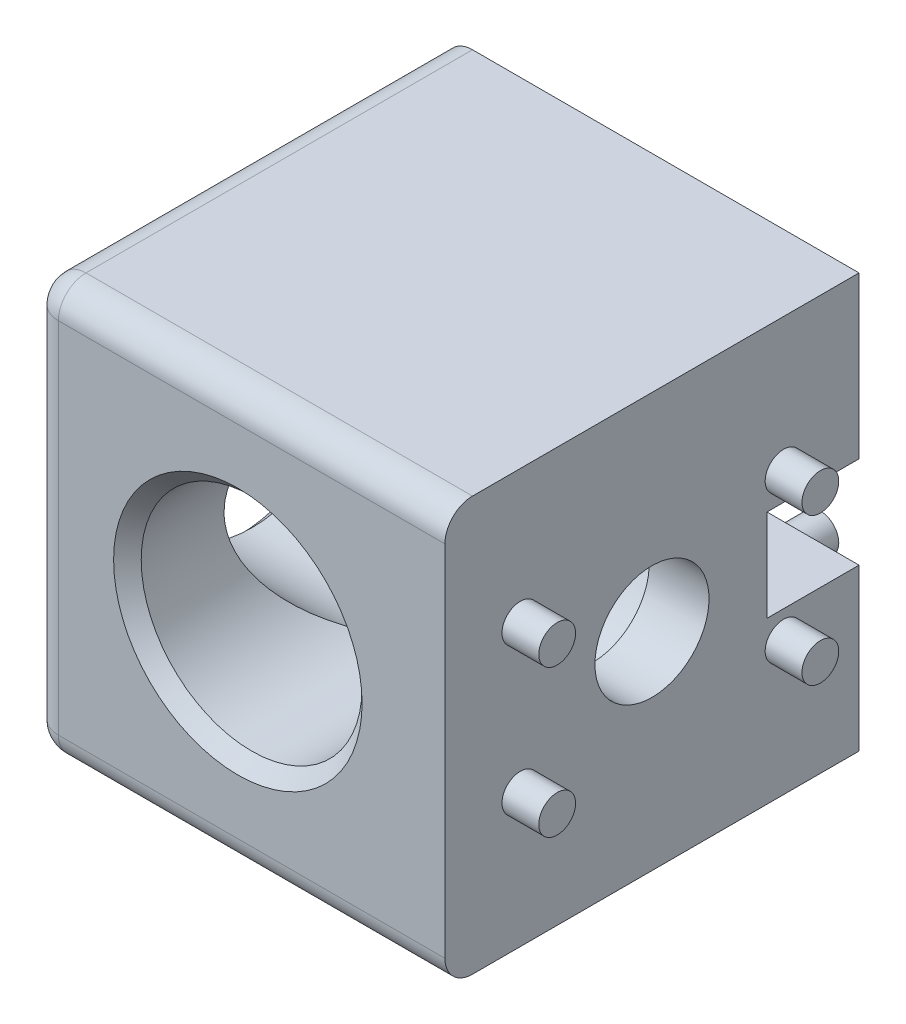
ISO-10303-21;
HEADER;
FILE_DESCRIPTION(('STEP AP214'),'2;1');
FILE_NAME('part.step','',(''),(''),'','','');
FILE_SCHEMA(('AUTOMOTIVE_DESIGN { 1 0 10303 214 1 1 1 1 }'));
ENDSEC;
DATA;
#1=APPLICATION_CONTEXT('core data for automotive mechanical design processes');
#2=APPLICATION_PROTOCOL_DEFINITION('international standard','automotive_design',2000,#1);
#3=PRODUCT_CONTEXT('',#1,'mechanical');
#4=PRODUCT('Part','Part','',(#3));
#5=PRODUCT_RELATED_PRODUCT_CATEGORY('part','',(#4));
#6=PRODUCT_DEFINITION_FORMATION('','',#4);
#7=PRODUCT_DEFINITION_CONTEXT('part definition',#1,'design');
#8=PRODUCT_DEFINITION('design','',#6,#7);
#9=PRODUCT_DEFINITION_SHAPE('','',#8);
#10=(LENGTH_UNIT() NAMED_UNIT(*) SI_UNIT(.MILLI.,.METRE.));
#11=(NAMED_UNIT(*) PLANE_ANGLE_UNIT() SI_UNIT($,.RADIAN.));
#12=(NAMED_UNIT(*) SI_UNIT($,.STERADIAN.) SOLID_ANGLE_UNIT());
#13=UNCERTAINTY_MEASURE_WITH_UNIT(LENGTH_MEASURE(1.E-05),#10,'distance_accuracy_value','');
#14=(GEOMETRIC_REPRESENTATION_CONTEXT(3) GLOBAL_UNCERTAINTY_ASSIGNED_CONTEXT((#13)) GLOBAL_UNIT_ASSIGNED_CONTEXT((#10,
#11,#12)) REPRESENTATION_CONTEXT('',''));
#15=CARTESIAN_POINT('',(0.,0.,0.));
#16=DIRECTION('',(0.,0.,1.));
#17=DIRECTION('',(1.,0.,0.));
#18=AXIS2_PLACEMENT_3D('',#15,#16,#17);
#19=CARTESIAN_POINT('',(0.,0.,22.5));
#20=DIRECTION('',(-1.,0.,0.));
#21=DIRECTION('',(0.,0.,1.));
#22=AXIS2_PLACEMENT_3D('',#19,#20,#21);
#23=PLANE('',#22);
#24=DIRECTION('',(0.,1.,0.));
#25=VECTOR('',#24,1.);
#26=CARTESIAN_POINT('',(-1.11022302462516E-13,0.,22.5));
#27=LINE('',#26,#25);
#28=CARTESIAN_POINT('',(-1.13135050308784E-13,-10.5,22.5000000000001));
#29=VERTEX_POINT('',#28);
#30=CARTESIAN_POINT('',(0.,-12.,22.5));
#31=VERTEX_POINT('',#30);
#32=EDGE_CURVE('E145',#29,#31,#27,.F.);
#33=ORIENTED_EDGE('',*,*,#32,.F.);
#34=DIRECTION('',(0.,0.,1.));
#35=VECTOR('',#34,1.);
#36=CARTESIAN_POINT('',(-1.13839299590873E-13,-10.5,6.5));
#37=LINE('',#36,#35);
#38=CARTESIAN_POINT('',(0.,-10.5,16.6905249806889));
#39=VERTEX_POINT('',#38);
#40=EDGE_CURVE('E128',#29,#39,#37,.F.);
#41=ORIENTED_EDGE('',*,*,#40,.T.);
#42=CARTESIAN_POINT('',(0.,0.,22.5));
#43=DIRECTION('',(-1.,0.,0.));
#44=DIRECTION('',(0.,0.,1.));
#45=AXIS2_PLACEMENT_3D('',#42,#43,#44);
#46=CIRCLE('',#45,12.);
#47=EDGE_CURVE('E20',#39,#31,#46,.T.);
#48=ORIENTED_EDGE('',*,*,#47,.T.);
#49=EDGE_LOOP('',(#33,#41,#48));
#50=FACE_BOUND('',#49,.T.);
#51=ADVANCED_FACE('F16',(#50),#23,.T.);
#52=CARTESIAN_POINT('',(0.,0.,22.5));
#53=DIRECTION('',(-1.,0.,0.));
#54=DIRECTION('',(0.,0.,1.));
#55=AXIS2_PLACEMENT_3D('',#52,#53,#54);
#56=PLANE('',#55);
#57=CARTESIAN_POINT('',(1.13161279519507E-13,0.,22.5));
#58=DIRECTION('',(-1.,0.,0.));
#59=DIRECTION('',(0.,0.,1.));
#60=AXIS2_PLACEMENT_3D('',#57,#58,#59);
#61=CIRCLE('',#60,12.);
#62=CARTESIAN_POINT('',(1.56312282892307E-13,12.,22.4999999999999));
#63=VERTEX_POINT('',#62);
#64=CARTESIAN_POINT('',(0.,10.5,16.6905249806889));
#65=VERTEX_POINT('',#64);
#66=EDGE_CURVE('E135',#63,#65,#61,.T.);
#67=ORIENTED_EDGE('',*,*,#66,.T.);
#68=DIRECTION('',(0.,0.,1.));
#69=VECTOR('',#68,1.);
#70=CARTESIAN_POINT('',(0.,10.5,6.5));
#71=LINE('',#70,#69);
#72=CARTESIAN_POINT('',(0.,10.5,22.5));
#73=VERTEX_POINT('',#72);
#74=EDGE_CURVE('E131',#65,#73,#71,.T.);
#75=ORIENTED_EDGE('',*,*,#74,.T.);
#76=DIRECTION('',(0.,1.,0.));
#77=VECTOR('',#76,1.);
#78=CARTESIAN_POINT('',(1.13161279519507E-13,0.,22.5));
#79=LINE('',#78,#77);
#80=EDGE_CURVE('E148',#63,#73,#79,.F.);
#81=ORIENTED_EDGE('',*,*,#80,.F.);
#82=EDGE_LOOP('',(#67,#75,#81));
#83=FACE_BOUND('',#82,.T.);
#84=ADVANCED_FACE('F373',(#83),#56,.T.);
#85=CARTESIAN_POINT('',(0.,0.,22.5));
#86=DIRECTION('',(0.,0.,1.));
#87=DIRECTION('',(1.,0.,0.));
#88=AXIS2_PLACEMENT_3D('',#85,#86,#87);
#89=PLANE('',#88);
#90=CARTESIAN_POINT('',(0.,0.,22.5));
#91=DIRECTION('',(0.,0.,1.));
#92=DIRECTION('',(1.,0.,0.));
#93=AXIS2_PLACEMENT_3D('',#90,#91,#92);
#94=CIRCLE('',#93,12.);
#95=CARTESIAN_POINT('',(5.80947501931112,-10.5,22.5));
#96=VERTEX_POINT('',#95);
#97=EDGE_CURVE('E344',#31,#96,#94,.T.);
#98=ORIENTED_EDGE('',*,*,#97,.T.);
#99=DIRECTION('',(-1.,0.,0.));
#100=VECTOR('',#99,1.);
#101=CARTESIAN_POINT('',(16.,-10.5,22.5000000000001));
#102=LINE('',#101,#100);
#103=EDGE_CURVE('E349',#96,#29,#102,.T.);
#104=ORIENTED_EDGE('',*,*,#103,.T.);
#105=ORIENTED_EDGE('',*,*,#32,.T.);
#106=EDGE_LOOP('',(#98,#104,#105));
#107=FACE_BOUND('',#106,.T.);
#108=ADVANCED_FACE('F368',(#107),#89,.T.);
#109=CARTESIAN_POINT('',(0.,0.,22.5));
#110=DIRECTION('',(0.,0.,1.));
#111=DIRECTION('',(1.,0.,0.));
#112=AXIS2_PLACEMENT_3D('',#109,#110,#111);
#113=PLANE('',#112);
#114=ORIENTED_EDGE('',*,*,#80,.T.);
#115=DIRECTION('',(-1.,0.,0.));
#116=VECTOR('',#115,1.);
#117=CARTESIAN_POINT('',(16.,10.5,22.5));
#118=LINE('',#117,#116);
#119=CARTESIAN_POINT('',(5.80947501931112,10.5,22.4999999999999));
#120=VERTEX_POINT('',#119);
#121=EDGE_CURVE('E134',#73,#120,#118,.F.);
#122=ORIENTED_EDGE('',*,*,#121,.T.);
#123=CARTESIAN_POINT('',(0.,0.,22.4999999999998));
#124=DIRECTION('',(0.,0.,1.));
#125=DIRECTION('',(1.,0.,0.));
#126=AXIS2_PLACEMENT_3D('',#123,#124,#125);
#127=CIRCLE('',#126,12.);
#128=EDGE_CURVE('E343',#120,#63,#127,.T.);
#129=ORIENTED_EDGE('',*,*,#128,.T.);
#130=EDGE_LOOP('',(#114,#122,#129));
#131=FACE_BOUND('',#130,.T.);
#132=ADVANCED_FACE('F364',(#131),#113,.T.);
#133=CARTESIAN_POINT('',(0.,0.,6.5));
#134=DIRECTION('',(0.,0.,1.));
#135=DIRECTION('',(1.,0.,0.));
#136=AXIS2_PLACEMENT_3D('',#133,#134,#135);
#137=CYLINDRICAL_SURFACE('',#136,10.5);
#138=CARTESIAN_POINT('',(0.,0.,22.5));
#139=DIRECTION('',(0.707106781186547,0.,0.707106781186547));
#140=DIRECTION('',(-0.707106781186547,0.,0.707106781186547));
#141=AXIS2_PLACEMENT_3D('',#138,#139,#140);
#142=ELLIPSE('',#141,14.8492424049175,10.5);
#143=EDGE_CURVE('E348',#29,#73,#142,.T.);
#144=ORIENTED_EDGE('',*,*,#143,.T.);
#145=ORIENTED_EDGE('',*,*,#74,.F.);
#146=CARTESIAN_POINT('',(0.,10.5,16.6905249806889));
#147=CARTESIAN_POINT('',(-0.17095684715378,10.5000419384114,16.6906723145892));
#148=CARTESIAN_POINT('',(-0.341815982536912,10.4958268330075,16.6829822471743));
#149=CARTESIAN_POINT('',(-0.681474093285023,10.479226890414,16.6530938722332));
#150=CARTESIAN_POINT('',(-0.85027694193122,10.4668611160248,16.6309294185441));
#151=CARTESIAN_POINT('',(-1.18198103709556,10.4345726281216,16.5737295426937));
#152=CARTESIAN_POINT('',(-1.34493375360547,10.4147792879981,16.5389147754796));
#153=CARTESIAN_POINT('',(-1.66706231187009,10.3680953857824,16.4580805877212));
#154=CARTESIAN_POINT('',(-1.82623560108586,10.3412001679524,16.4120538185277));
#155=CARTESIAN_POINT('',(-2.211463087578,10.2671052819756,16.2876030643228));
#156=CARTESIAN_POINT('',(-2.43512025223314,10.2162284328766,16.2039518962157));
#157=CARTESIAN_POINT('',(-2.87299969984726,10.1018389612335,16.0220065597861));
#158=CARTESIAN_POINT('',(-3.08721738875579,10.0383202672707,15.9237053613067));
#159=CARTESIAN_POINT('',(-3.50852470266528,9.89898622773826,15.7157628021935));
#160=CARTESIAN_POINT('',(-3.71553098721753,9.8230635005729,15.6060257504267));
#161=CARTESIAN_POINT('',(-4.12099645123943,9.65997624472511,15.3792975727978));
#162=CARTESIAN_POINT('',(-4.31945257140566,9.57280773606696,15.2623038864));
#163=CARTESIAN_POINT('',(-4.82243142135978,9.33332872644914,14.9537268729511));
#164=CARTESIAN_POINT('',(-5.12091286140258,9.17279217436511,14.7586325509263));
#165=CARTESIAN_POINT('',(-5.69928428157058,8.82507808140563,14.3644450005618));
#166=CARTESIAN_POINT('',(-5.97916420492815,8.6378862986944,14.1653496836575));
#167=CARTESIAN_POINT('',(-6.51976493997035,8.23744395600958,13.7693864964));
#168=CARTESIAN_POINT('',(-6.78053532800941,8.02426494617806,13.572514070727));
#169=CARTESIAN_POINT('',(-7.28288255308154,7.5712561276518,13.1852349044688));
#170=CARTESIAN_POINT('',(-7.52446796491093,7.33143834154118,12.9948252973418));
#171=CARTESIAN_POINT('',(-7.93351311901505,6.88323979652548,12.6674362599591));
#172=CARTESIAN_POINT('',(-8.1052295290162,6.68034121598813,12.5282519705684));
#173=CARTESIAN_POINT('',(-8.43517170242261,6.2585585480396,12.2582655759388));
#174=CARTESIAN_POINT('',(-8.59339773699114,6.03967478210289,12.1274633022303));
#175=CARTESIAN_POINT('',(-8.89478212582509,5.58631184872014,11.876431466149));
#176=CARTESIAN_POINT('',(-9.0379526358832,5.3518455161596,11.7561933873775));
#177=CARTESIAN_POINT('',(-9.30764950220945,4.86768882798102,11.5283485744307));
#178=CARTESIAN_POINT('',(-9.43417960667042,4.61800191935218,11.4207389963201));
#179=CARTESIAN_POINT('',(-9.64679644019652,4.15235318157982,11.239083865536));
#180=CARTESIAN_POINT('',(-9.73602304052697,3.93880221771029,11.1625232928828));
#181=CARTESIAN_POINT('',(-9.90114781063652,3.5030739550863,11.0204111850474));
#182=CARTESIAN_POINT('',(-9.97704868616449,3.28089841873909,10.9548574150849));
#183=CARTESIAN_POINT('',(-10.1143708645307,2.82932748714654,10.8359819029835));
#184=CARTESIAN_POINT('',(-10.1758157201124,2.59994453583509,10.782640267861));
#185=CARTESIAN_POINT('',(-10.2834033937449,2.13506900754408,10.6890863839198));
#186=CARTESIAN_POINT('',(-10.3295514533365,1.89957855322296,10.6488696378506));
#187=CARTESIAN_POINT('',(-10.4113975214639,1.3889297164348,10.5774694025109));
#188=CARTESIAN_POINT('',(-10.4445491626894,1.1130449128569,10.5484941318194));
#189=CARTESIAN_POINT('',(-10.4888518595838,0.558098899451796,10.5097582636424));
#190=CARTESIAN_POINT('',(-10.4999981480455,0.279037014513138,10.5000018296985));
#191=CARTESIAN_POINT('',(-10.5000016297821,-0.245561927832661,10.499998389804));
#192=CARTESIAN_POINT('',(-10.4913723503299,-0.491104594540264,10.5075513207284));
#193=CARTESIAN_POINT('',(-10.45702544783,-0.980163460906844,10.5375875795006));
#194=CARTESIAN_POINT('',(-10.4313016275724,-1.22367889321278,10.5600763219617));
#195=CARTESIAN_POINT('',(-10.3632096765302,-1.70690121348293,10.6195185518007));
#196=CARTESIAN_POINT('',(-10.3208192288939,-1.94660254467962,10.6564914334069));
#197=CARTESIAN_POINT('',(-10.2201695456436,-2.42006439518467,10.7440971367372));
#198=CARTESIAN_POINT('',(-10.1619113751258,-2.65382531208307,10.7947290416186));
#199=CARTESIAN_POINT('',(-10.0309229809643,-3.11240769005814,10.9082634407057));
#200=CARTESIAN_POINT('',(-9.95829098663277,-3.33727803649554,10.9710825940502));
#201=CARTESIAN_POINT('',(-9.79936784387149,-3.77854359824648,11.1080735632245));
#202=CARTESIAN_POINT('',(-9.71307676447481,-3.99493885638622,11.1822453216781));
#203=CARTESIAN_POINT('',(-9.5279158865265,-4.4183959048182,11.3407486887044));
#204=CARTESIAN_POINT('',(-9.4290462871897,-4.62545784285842,11.4250801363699));
#205=CARTESIAN_POINT('',(-9.2197654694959,-5.02968690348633,11.6027060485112));
#206=CARTESIAN_POINT('',(-9.10935170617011,-5.22685182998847,11.696002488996));
#207=CARTESIAN_POINT('',(-8.83312486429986,-5.6853006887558,11.9280329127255));
#208=CARTESIAN_POINT('',(-8.66242104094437,-5.94183349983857,12.0703674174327));
#209=CARTESIAN_POINT('',(-8.30296073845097,-6.4345884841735,12.3669435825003));
#210=CARTESIAN_POINT('',(-8.11419777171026,-6.67080330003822,12.521189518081));
#211=CARTESIAN_POINT('',(-7.72006529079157,-7.12325751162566,12.8389559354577));
#212=CARTESIAN_POINT('',(-7.51466182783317,-7.33945403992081,13.0024951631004));
#213=CARTESIAN_POINT('',(-7.08895670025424,-7.75141491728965,13.3356272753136));
#214=CARTESIAN_POINT('',(-6.86865702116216,-7.94718198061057,13.5052193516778));
#215=CARTESIAN_POINT('',(-6.40912270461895,-8.32244016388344,13.8511012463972));
#216=CARTESIAN_POINT('',(-6.16958673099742,-8.50150098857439,14.027456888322));
#217=CARTESIAN_POINT('',(-5.67590652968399,-8.83874956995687,14.3799028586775));
#218=CARTESIAN_POINT('',(-5.42175780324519,-8.99693084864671,14.5559930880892));
#219=CARTESIAN_POINT('',(-4.8986499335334,-9.29211461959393,14.9033886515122));
#220=CARTESIAN_POINT('',(-4.62970191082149,-9.42913272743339,15.0746974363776));
#221=CARTESIAN_POINT('',(-4.07574300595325,-9.68147241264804,15.4068738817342));
#222=CARTESIAN_POINT('',(-3.79074423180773,-9.79681006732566,15.5677492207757));
#223=CARTESIAN_POINT('',(-3.33722139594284,-9.95698593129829,15.8016071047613));
#224=CARTESIAN_POINT('',(-3.1749432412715,-10.0099655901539,15.8811772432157));
#225=CARTESIAN_POINT('',(-2.84480130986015,-10.1087489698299,16.0330547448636));
#226=CARTESIAN_POINT('',(-2.67693635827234,-10.154551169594,16.1053605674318));
#227=CARTESIAN_POINT('',(-2.33650142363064,-10.2382280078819,16.2402110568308));
#228=CARTESIAN_POINT('',(-2.16396257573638,-10.2761450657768,16.3028074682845));
#229=CARTESIAN_POINT('',(-1.81356370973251,-10.343730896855,16.4162839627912));
#230=CARTESIAN_POINT('',(-1.63570789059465,-10.3734059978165,16.4671730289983));
#231=CARTESIAN_POINT('',(-1.33775627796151,-10.4151118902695,16.539585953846));
#232=CARTESIAN_POINT('',(-1.21899656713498,-10.4296937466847,16.5651753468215));
#233=CARTESIAN_POINT('',(-0.979828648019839,-10.4548739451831,16.6096467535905));
#234=CARTESIAN_POINT('',(-0.859420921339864,-10.4654734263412,16.6285306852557));
#235=CARTESIAN_POINT('',(-0.616230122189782,-10.4826161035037,16.6591874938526));
#236=CARTESIAN_POINT('',(-0.493435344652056,-10.4891194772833,16.6708905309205));
#237=CARTESIAN_POINT('',(-0.247100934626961,-10.4978194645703,16.6865842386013));
#238=CARTESIAN_POINT('',(-0.123560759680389,-10.5000124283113,16.6905683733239));
#239=CARTESIAN_POINT('',(0.,-10.5,16.6905249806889));
#240=B_SPLINE_CURVE_WITH_KNOTS('',3,(#146,#147,#148,#149,#150,#151,#152,#153,#154,#155,#156,
#157,#158,#159,#160,#161,#162,#163,#164,#165,#166,#167,#168,#169,#170,#171,#172,#173,#174,#175,
#176,#177,#178,#179,#180,#181,#182,#183,#184,#185,#186,#187,#188,#189,#190,#191,#192,#193,#194,
#195,#196,#197,#198,#199,#200,#201,#202,#203,#204,#205,#206,#207,#208,#209,#210,#211,#212,#213,
#214,#215,#216,#217,#218,#219,#220,#221,#222,#223,#224,#225,#226,#227,#228,#229,#230,#231,#232,
#233,#234,#235,#236,#237,#238,#239),.UNSPECIFIED.,.F.,.F.,(4,2,2,2,2,2,2,2,2,2,2,2,2,2,2,2,2,2,
2,2,2,2,2,2,2,2,2,2,2,2,2,2,2,2,2,2,2,2,2,2,2,2,2,2,2,2,4),(0.,0.51248970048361,
1.02378502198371,1.52655943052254,2.02966426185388,2.76087250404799,3.49243277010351,
4.23069898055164,4.96922719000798,6.14080877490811,7.31301869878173,8.48207115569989,
9.65059812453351,10.5499741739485,11.4493321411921,12.3479583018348,13.2463817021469,
13.9770086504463,14.7074870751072,15.43676698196,16.1657967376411,17.0023879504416,
17.8391603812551,18.5755481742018,19.3122030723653,20.0498477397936,20.7874429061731,
21.5201614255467,22.252876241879,22.9855794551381,23.7184445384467,24.7352261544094,
25.7523744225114,26.7716527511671,27.7907954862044,28.8314303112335,29.8723872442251,
30.9125723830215,31.9519830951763,32.5167215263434,33.0815794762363,33.6433152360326,
34.2046185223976,34.5714631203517,34.9382027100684,35.3084548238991,35.6790203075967),.UNSPECIFIED.);
#241=EDGE_CURVE('E123',#65,#39,#240,.T.);
#242=ORIENTED_EDGE('',*,*,#241,.T.);
#243=ORIENTED_EDGE('',*,*,#40,.F.);
#244=EDGE_LOOP('',(#144,#145,#242,#243));
#245=FACE_BOUND('',#244,.T.);
#246=CARTESIAN_POINT('',(0.,0.,6.5));
#247=DIRECTION('',(0.,0.,1.));
#248=DIRECTION('',(1.,0.,0.));
#249=AXIS2_PLACEMENT_3D('',#246,#247,#248);
#250=CIRCLE('',#249,10.5);
#251=CARTESIAN_POINT('',(10.5,0.,6.5));
#252=VERTEX_POINT('',#251);
#253=EDGE_CURVE('E161',#252,#252,#250,.T.);
#254=ORIENTED_EDGE('',*,*,#253,.F.);
#255=EDGE_LOOP('',(#254));
#256=FACE_BOUND('',#255,.T.);
#257=ADVANCED_FACE('F125',(#245,#256),#137,.F.);
#258=CARTESIAN_POINT('',(0.,0.,22.5));
#259=DIRECTION('',(-1.,0.,0.));
#260=DIRECTION('',(0.,0.,1.));
#261=AXIS2_PLACEMENT_3D('',#258,#259,#260);
#262=CYLINDRICAL_SURFACE('',#261,12.);
#263=CARTESIAN_POINT('',(0.,0.,22.5));
#264=DIRECTION('',(-0.707106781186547,0.,-0.707106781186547));
#265=DIRECTION('',(-0.707106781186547,0.,0.707106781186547));
#266=AXIS2_PLACEMENT_3D('',#263,#264,#265);
#267=ELLIPSE('',#266,16.9705627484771,12.);
#268=EDGE_CURVE('E142',#63,#31,#267,.F.);
#269=ORIENTED_EDGE('',*,*,#268,.T.);
#270=ORIENTED_EDGE('',*,*,#47,.F.);
#271=ORIENTED_EDGE('',*,*,#241,.F.);
#272=ORIENTED_EDGE('',*,*,#66,.F.);
#273=EDGE_LOOP('',(#269,#270,#271,#272));
#274=FACE_BOUND('',#273,.T.);
#275=CARTESIAN_POINT('',(-21.,0.,22.5));
#276=DIRECTION('',(-1.,0.,0.));
#277=DIRECTION('',(0.,0.,1.));
#278=AXIS2_PLACEMENT_3D('',#275,#276,#277);
#279=CIRCLE('',#278,12.);
#280=CARTESIAN_POINT('',(-21.,0.,34.5));
#281=VERTEX_POINT('',#280);
#282=EDGE_CURVE('E151',#281,#281,#279,.T.);
#283=ORIENTED_EDGE('',*,*,#282,.T.);
#284=EDGE_LOOP('',(#283));
#285=FACE_BOUND('',#284,.T.);
#286=ADVANCED_FACE('F139',(#274,#285),#262,.F.);
#287=CARTESIAN_POINT('',(16.,0.,22.5));
#288=DIRECTION('',(-1.,0.,0.));
#289=DIRECTION('',(0.,0.,1.));
#290=AXIS2_PLACEMENT_3D('',#287,#288,#289);
#291=CYLINDRICAL_SURFACE('',#290,10.5);
#292=ORIENTED_EDGE('',*,*,#103,.F.);
#293=CARTESIAN_POINT('',(5.80947501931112,-10.5,22.5000000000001));
#294=CARTESIAN_POINT('',(5.80932768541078,-10.5000419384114,22.6709568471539));
#295=CARTESIAN_POINT('',(5.81701775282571,-10.4958268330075,22.841815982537));
#296=CARTESIAN_POINT('',(5.84690612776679,-10.479226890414,23.1814740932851));
#297=CARTESIAN_POINT('',(5.86907058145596,-10.4668611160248,23.3502769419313));
#298=CARTESIAN_POINT('',(5.92627045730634,-10.4345726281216,23.6819810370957));
#299=CARTESIAN_POINT('',(5.96108522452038,-10.4147792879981,23.8449337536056));
#300=CARTESIAN_POINT('',(6.04191941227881,-10.3680953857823,24.1670623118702));
#301=CARTESIAN_POINT('',(6.0879461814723,-10.3412001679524,24.326235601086));
#302=CARTESIAN_POINT('',(6.21239693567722,-10.2671052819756,24.7114630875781));
#303=CARTESIAN_POINT('',(6.29604810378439,-10.2162284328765,24.9351202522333));
#304=CARTESIAN_POINT('',(6.47799344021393,-10.1018389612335,25.3729996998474));
#305=CARTESIAN_POINT('',(6.57629463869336,-10.0383202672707,25.5872173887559));
#306=CARTESIAN_POINT('',(6.78423719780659,-9.89898622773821,26.0085247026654));
#307=CARTESIAN_POINT('',(6.89397424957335,-9.82306350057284,26.2155309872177));
#308=CARTESIAN_POINT('',(7.12070242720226,-9.65997624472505,26.6209964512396));
#309=CARTESIAN_POINT('',(7.23769611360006,-9.57280773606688,26.8194525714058));
#310=CARTESIAN_POINT('',(7.54627312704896,-9.33332872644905,27.3224314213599));
#311=CARTESIAN_POINT('',(7.74136744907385,-9.17279217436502,27.6209128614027));
#312=CARTESIAN_POINT('',(8.13555499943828,-8.82507808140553,28.1992842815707));
#313=CARTESIAN_POINT('',(8.33465031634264,-8.63788629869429,28.4791642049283));
#314=CARTESIAN_POINT('',(8.73061350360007,-8.23744395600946,29.0197649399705));
#315=CARTESIAN_POINT('',(8.92748592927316,-8.02426494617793,29.2805353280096));
#316=CARTESIAN_POINT('',(9.31476509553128,-7.57125612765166,29.7828825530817));
#317=CARTESIAN_POINT('',(9.50517470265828,-7.33143834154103,30.0244679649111));
#318=CARTESIAN_POINT('',(9.83256374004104,-6.88323979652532,30.4335131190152));
#319=CARTESIAN_POINT('',(9.97174802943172,-6.68034121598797,30.6052295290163));
#320=CARTESIAN_POINT('',(10.2417344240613,-6.25855854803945,30.9351717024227));
#321=CARTESIAN_POINT('',(10.3725366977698,-6.03967478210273,31.0933977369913));
#322=CARTESIAN_POINT('',(10.6235685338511,-5.58631184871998,31.3947821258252));
#323=CARTESIAN_POINT('',(10.7438066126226,-5.35184551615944,31.5379526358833));
#324=CARTESIAN_POINT('',(10.9716514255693,-4.86768882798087,31.8076495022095));
#325=CARTESIAN_POINT('',(11.0792610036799,-4.61800191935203,31.9341796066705));
#326=CARTESIAN_POINT('',(11.260916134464,-4.15235318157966,32.1467964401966));
#327=CARTESIAN_POINT('',(11.3374767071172,-3.93880221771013,32.236023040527));
#328=CARTESIAN_POINT('',(11.4795888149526,-3.50307395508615,32.4011478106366));
#329=CARTESIAN_POINT('',(11.5451425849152,-3.28089841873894,32.4770486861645));
#330=CARTESIAN_POINT('',(11.6640180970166,-2.82932748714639,32.6143708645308));
#331=CARTESIAN_POINT('',(11.717359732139,-2.59994453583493,32.6758157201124));
#332=CARTESIAN_POINT('',(11.8109136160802,-2.13506900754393,32.7834033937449));
#333=CARTESIAN_POINT('',(11.8511303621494,-1.89957855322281,32.8295514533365));
#334=CARTESIAN_POINT('',(11.9225305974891,-1.38892971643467,32.9113975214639));
#335=CARTESIAN_POINT('',(11.9515058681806,-1.1130449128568,32.9445491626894));
#336=CARTESIAN_POINT('',(11.9902417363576,-0.558098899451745,32.9888518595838));
#337=CARTESIAN_POINT('',(11.9999981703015,-0.279037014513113,32.9999981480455));
#338=CARTESIAN_POINT('',(12.000001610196,0.245561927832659,33.0000016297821));
#339=CARTESIAN_POINT('',(11.9924486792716,0.49110459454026,32.9913723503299));
#340=CARTESIAN_POINT('',(11.9624124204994,0.98016346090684,32.95702544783));
#341=CARTESIAN_POINT('',(11.9399236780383,1.22367889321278,32.9313016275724));
#342=CARTESIAN_POINT('',(11.8804814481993,1.70690121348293,32.8632096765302));
#343=CARTESIAN_POINT('',(11.8435085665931,1.94660254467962,32.8208192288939));
#344=CARTESIAN_POINT('',(11.7559028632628,2.42006439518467,32.7201695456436));
#345=CARTESIAN_POINT('',(11.7052709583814,2.65382531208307,32.6619113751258));
#346=CARTESIAN_POINT('',(11.5917365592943,3.11240769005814,32.5309229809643));
#347=CARTESIAN_POINT('',(11.5289174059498,3.33727803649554,32.4582909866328));
#348=CARTESIAN_POINT('',(11.3919264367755,3.77854359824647,32.2993678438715));
#349=CARTESIAN_POINT('',(11.3177546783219,3.99493885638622,32.2130767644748));
#350=CARTESIAN_POINT('',(11.1592513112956,4.4183959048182,32.0279158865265));
#351=CARTESIAN_POINT('',(11.0749198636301,4.62545784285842,31.9290462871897));
#352=CARTESIAN_POINT('',(10.8972939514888,5.02968690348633,31.7197654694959));
#353=CARTESIAN_POINT('',(10.803997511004,5.22685182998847,31.6093517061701));
#354=CARTESIAN_POINT('',(10.5719670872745,5.6853006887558,31.3331248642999));
#355=CARTESIAN_POINT('',(10.4296325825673,5.94183349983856,31.1624210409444));
#356=CARTESIAN_POINT('',(10.1330564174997,6.4345884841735,30.802960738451));
#357=CARTESIAN_POINT('',(9.97881048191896,6.67080330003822,30.6141977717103));
#358=CARTESIAN_POINT('',(9.6610440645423,7.12325751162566,30.2200652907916));
#359=CARTESIAN_POINT('',(9.4975048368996,7.33945403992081,30.0146618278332));
#360=CARTESIAN_POINT('',(9.16437272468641,7.75141491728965,29.5889567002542));
#361=CARTESIAN_POINT('',(8.99478064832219,7.94718198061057,29.3686570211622));
#362=CARTESIAN_POINT('',(8.64889875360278,8.32244016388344,28.9091227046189));
#363=CARTESIAN_POINT('',(8.47254311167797,8.50150098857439,28.6695867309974));
#364=CARTESIAN_POINT('',(8.12009714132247,8.83874956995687,28.175906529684));
#365=CARTESIAN_POINT('',(7.94400691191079,8.99693084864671,27.9217578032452));
#366=CARTESIAN_POINT('',(7.59661134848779,9.29211461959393,27.3986499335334));
#367=CARTESIAN_POINT('',(7.4253025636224,9.42913272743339,27.1297019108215));
#368=CARTESIAN_POINT('',(7.0931261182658,9.68147241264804,26.5757430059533));
#369=CARTESIAN_POINT('',(6.93225077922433,9.79681006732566,26.2907442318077));
#370=CARTESIAN_POINT('',(6.69839289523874,9.95698593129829,25.8372213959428));
#371=CARTESIAN_POINT('',(6.61882275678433,10.0099655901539,25.6749432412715));
#372=CARTESIAN_POINT('',(6.4669452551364,10.1087489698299,25.3448013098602));
#373=CARTESIAN_POINT('',(6.39463943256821,10.154551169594,25.1769363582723));
#374=CARTESIAN_POINT('',(6.25978894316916,10.2382280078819,24.8365014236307));
#375=CARTESIAN_POINT('',(6.19719253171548,10.2761450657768,24.6639625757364));
#376=CARTESIAN_POINT('',(6.08371603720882,10.343730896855,24.3135637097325));
#377=CARTESIAN_POINT('',(6.03282697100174,10.3734059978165,24.1357078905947));
#378=CARTESIAN_POINT('',(5.96041404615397,10.4151118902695,23.8377562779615));
#379=CARTESIAN_POINT('',(5.93482465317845,10.4296937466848,23.718996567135));
#380=CARTESIAN_POINT('',(5.8903532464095,10.4548739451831,23.4798286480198));
#381=CARTESIAN_POINT('',(5.87146931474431,10.4654734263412,23.3594209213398));
#382=CARTESIAN_POINT('',(5.84081250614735,10.4826161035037,23.1162301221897));
#383=CARTESIAN_POINT('',(5.82910946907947,10.4891194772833,22.993435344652));
#384=CARTESIAN_POINT('',(5.81341576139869,10.4978194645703,22.7471009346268));
#385=CARTESIAN_POINT('',(5.80943162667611,10.5000124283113,22.6235607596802));
#386=CARTESIAN_POINT('',(5.80947501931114,10.5,22.4999999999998));
#387=B_SPLINE_CURVE_WITH_KNOTS('',3,(#293,#294,#295,#296,#297,#298,#299,#300,#301,#302,#303,
#304,#305,#306,#307,#308,#309,#310,#311,#312,#313,#314,#315,#316,#317,#318,#319,#320,#321,#322,
#323,#324,#325,#326,#327,#328,#329,#330,#331,#332,#333,#334,#335,#336,#337,#338,#339,#340,#341,
#342,#343,#344,#345,#346,#347,#348,#349,#350,#351,#352,#353,#354,#355,#356,#357,#358,#359,#360,
#361,#362,#363,#364,#365,#366,#367,#368,#369,#370,#371,#372,#373,#374,#375,#376,#377,#378,#379,
#380,#381,#382,#383,#384,#385,#386),.UNSPECIFIED.,.F.,.F.,(4,2,2,2,2,2,2,2,2,2,2,2,2,2,2,2,2,2,
2,2,2,2,2,2,2,2,2,2,2,2,2,2,2,2,2,2,2,2,2,2,2,2,2,2,2,2,4),(0.,0.512489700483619,
1.02378502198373,1.52655943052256,2.02966426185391,2.76087250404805,3.49243277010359,
4.23069898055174,4.96922719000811,6.14080877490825,7.31301869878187,8.48207115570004,
9.65059812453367,10.5499741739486,11.4493321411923,12.3479583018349,13.246381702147,
13.9770086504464,14.7074870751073,15.4367669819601,16.1657967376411,17.0023879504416,
17.839160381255,18.5755481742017,19.3122030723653,20.0498477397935,20.7874429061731,
21.5201614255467,22.2528762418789,22.985579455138,23.7184445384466,24.7352261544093,
25.7523744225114,26.771652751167,27.7907954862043,28.8314303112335,29.872387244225,
30.9125723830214,31.9519830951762,32.5167215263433,33.0815794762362,33.6433152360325,
34.2046185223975,34.5714631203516,34.9382027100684,35.3084548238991,35.6790203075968),.UNSPECIFIED.);
#388=EDGE_CURVE('E335',#96,#120,#387,.T.);
#389=ORIENTED_EDGE('',*,*,#388,.T.);
#390=ORIENTED_EDGE('',*,*,#121,.F.);
#391=ORIENTED_EDGE('',*,*,#143,.F.);
#392=EDGE_LOOP('',(#292,#389,#390,#391));
#393=FACE_BOUND('',#392,.T.);
#394=CARTESIAN_POINT('',(16.,0.,22.5));
#395=DIRECTION('',(-1.,0.,0.));
#396=DIRECTION('',(0.,0.,1.));
#397=AXIS2_PLACEMENT_3D('',#394,#395,#396);
#398=CIRCLE('',#397,10.5);
#399=CARTESIAN_POINT('',(16.,0.,33.));
#400=VERTEX_POINT('',#399);
#401=EDGE_CURVE('E394',#400,#400,#398,.T.);
#402=ORIENTED_EDGE('',*,*,#401,.F.);
#403=EDGE_LOOP('',(#402));
#404=FACE_BOUND('',#403,.T.);
#405=ADVANCED_FACE('F330',(#393,#404),#291,.F.);
#406=CARTESIAN_POINT('',(0.,0.,22.5));
#407=DIRECTION('',(0.,0.,1.));
#408=DIRECTION('',(1.,0.,0.));
#409=AXIS2_PLACEMENT_3D('',#406,#407,#408);
#410=CYLINDRICAL_SURFACE('',#409,12.);
#411=ORIENTED_EDGE('',*,*,#388,.F.);
#412=ORIENTED_EDGE('',*,*,#97,.F.);
#413=ORIENTED_EDGE('',*,*,#268,.F.);
#414=ORIENTED_EDGE('',*,*,#128,.F.);
#415=EDGE_LOOP('',(#411,#412,#413,#414));
#416=FACE_BOUND('',#415,.T.);
#417=CARTESIAN_POINT('',(0.,0.,43.5));
#418=DIRECTION('',(0.,0.,1.));
#419=DIRECTION('',(1.,0.,0.));
#420=AXIS2_PLACEMENT_3D('',#417,#418,#419);
#421=CIRCLE('',#420,12.);
#422=CARTESIAN_POINT('',(12.,0.,43.5));
#423=VERTEX_POINT('',#422);
#424=EDGE_CURVE('E390',#423,#423,#421,.T.);
#425=ORIENTED_EDGE('',*,*,#424,.T.);
#426=EDGE_LOOP('',(#425));
#427=FACE_BOUND('',#426,.T.);
#428=ADVANCED_FACE('F325',(#416,#427),#410,.F.);
#429=CARTESIAN_POINT('',(0.,0.,6.5));
#430=DIRECTION('',(0.,0.,1.));
#431=DIRECTION('',(1.,0.,0.));
#432=AXIS2_PLACEMENT_3D('',#429,#430,#431);
#433=PLANE('',#432);
#434=ORIENTED_EDGE('',*,*,#253,.T.);
#435=EDGE_LOOP('',(#434));
#436=FACE_BOUND('',#435,.T.);
#437=CARTESIAN_POINT('',(0.,0.,6.5));
#438=DIRECTION('',(0.,0.,1.));
#439=DIRECTION('',(1.,0.,0.));
#440=AXIS2_PLACEMENT_3D('',#437,#438,#439);
#441=CIRCLE('',#440,6.2);
#442=CARTESIAN_POINT('',(6.2,0.,6.5));
#443=VERTEX_POINT('',#442);
#444=EDGE_CURVE('E404',#443,#443,#441,.F.);
#445=ORIENTED_EDGE('',*,*,#444,.T.);
#446=EDGE_LOOP('',(#445));
#447=FACE_BOUND('',#446,.T.);
#448=ADVANCED_FACE('F321',(#436,#447),#433,.T.);
#449=CARTESIAN_POINT('',(-22.5,0.,22.5));
#450=DIRECTION('',(-1.,0.,0.));
#451=DIRECTION('',(0.,0.,1.));
#452=AXIS2_PLACEMENT_3D('',#449,#450,#451);
#453=CONICAL_SURFACE('',#452,13.5,0.785398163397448);
#454=ORIENTED_EDGE('',*,*,#282,.F.);
#455=EDGE_LOOP('',(#454));
#456=FACE_BOUND('',#455,.T.);
#457=CARTESIAN_POINT('',(-22.5,0.,22.5));
#458=DIRECTION('',(-1.,0.,0.));
#459=DIRECTION('',(0.,0.,1.));
#460=AXIS2_PLACEMENT_3D('',#457,#458,#459);
#461=CIRCLE('',#460,13.5);
#462=CARTESIAN_POINT('',(-22.5,0.,36.));
#463=VERTEX_POINT('',#462);
#464=EDGE_CURVE('E403',#463,#463,#461,.F.);
#465=ORIENTED_EDGE('',*,*,#464,.F.);
#466=EDGE_LOOP('',(#465));
#467=FACE_BOUND('',#466,.T.);
#468=ADVANCED_FACE('F317',(#456,#467),#453,.F.);
#469=CARTESIAN_POINT('',(14.3000000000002,-8.,-4.));
#470=DIRECTION('',(0.,0.,1.));
#471=DIRECTION('',(1.,0.,0.));
#472=AXIS2_PLACEMENT_3D('',#469,#470,#471);
#473=PLANE('',#472);
#474=CARTESIAN_POINT('',(14.3000000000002,-8.,-4.));
#475=DIRECTION('',(0.,0.,1.));
#476=DIRECTION('',(1.,0.,0.));
#477=AXIS2_PLACEMENT_3D('',#474,#475,#476);
#478=CIRCLE('',#477,2.);
#479=CARTESIAN_POINT('',(16.3000000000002,-8.,-4.));
#480=VERTEX_POINT('',#479);
#481=EDGE_CURVE('E423',#480,#480,#478,.T.);
#482=ORIENTED_EDGE('',*,*,#481,.F.);
#483=EDGE_LOOP('',(#482));
#484=FACE_BOUND('',#483,.T.);
#485=ADVANCED_FACE('F313',(#484),#473,.F.);
#486=CARTESIAN_POINT('',(-14.2999999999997,-8.,-4.));
#487=DIRECTION('',(0.,0.,1.));
#488=DIRECTION('',(1.,0.,0.));
#489=AXIS2_PLACEMENT_3D('',#486,#487,#488);
#490=PLANE('',#489);
#491=CARTESIAN_POINT('',(-14.2999999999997,-8.,-4.));
#492=DIRECTION('',(0.,0.,1.));
#493=DIRECTION('',(1.,0.,0.));
#494=AXIS2_PLACEMENT_3D('',#491,#492,#493);
#495=CIRCLE('',#494,2.);
#496=CARTESIAN_POINT('',(-12.2999999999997,-8.,-4.));
#497=VERTEX_POINT('',#496);
#498=EDGE_CURVE('E559',#497,#497,#495,.T.);
#499=ORIENTED_EDGE('',*,*,#498,.F.);
#500=EDGE_LOOP('',(#499));
#501=FACE_BOUND('',#500,.T.);
#502=ADVANCED_FACE('F309',(#501),#490,.F.);
#503=CARTESIAN_POINT('',(-14.2999999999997,8.,-4.));
#504=DIRECTION('',(0.,0.,1.));
#505=DIRECTION('',(1.,0.,0.));
#506=AXIS2_PLACEMENT_3D('',#503,#504,#505);
#507=PLANE('',#506);
#508=CARTESIAN_POINT('',(-14.2999999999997,8.,-4.));
#509=DIRECTION('',(0.,0.,1.));
#510=DIRECTION('',(1.,0.,0.));
#511=AXIS2_PLACEMENT_3D('',#508,#509,#510);
#512=CIRCLE('',#511,2.);
#513=CARTESIAN_POINT('',(-12.2999999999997,8.,-4.));
#514=VERTEX_POINT('',#513);
#515=EDGE_CURVE('E556',#514,#514,#512,.T.);
#516=ORIENTED_EDGE('',*,*,#515,.F.);
#517=EDGE_LOOP('',(#516));
#518=FACE_BOUND('',#517,.T.);
#519=ADVANCED_FACE('F305',(#518),#507,.F.);
#520=CARTESIAN_POINT('',(14.3000000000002,8.,-4.));
#521=DIRECTION('',(0.,0.,1.));
#522=DIRECTION('',(1.,0.,0.));
#523=AXIS2_PLACEMENT_3D('',#520,#521,#522);
#524=PLANE('',#523);
#525=CARTESIAN_POINT('',(14.3000000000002,8.,-4.));
#526=DIRECTION('',(0.,0.,1.));
#527=DIRECTION('',(1.,0.,0.));
#528=AXIS2_PLACEMENT_3D('',#525,#526,#527);
#529=CIRCLE('',#528,2.);
#530=CARTESIAN_POINT('',(16.3000000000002,8.,-4.));
#531=VERTEX_POINT('',#530);
#532=EDGE_CURVE('E553',#531,#531,#529,.T.);
#533=ORIENTED_EDGE('',*,*,#532,.F.);
#534=EDGE_LOOP('',(#533));
#535=FACE_BOUND('',#534,.T.);
#536=ADVANCED_FACE('F185',(#535),#524,.F.);
#537=CARTESIAN_POINT('',(16.,0.,22.5));
#538=DIRECTION('',(-1.,0.,0.));
#539=DIRECTION('',(0.,0.,1.));
#540=AXIS2_PLACEMENT_3D('',#537,#538,#539);
#541=PLANE('',#540);
#542=ORIENTED_EDGE('',*,*,#401,.T.);
#543=EDGE_LOOP('',(#542));
#544=FACE_BOUND('',#543,.T.);
#545=CARTESIAN_POINT('',(16.,0.,22.5));
#546=DIRECTION('',(-1.,0.,0.));
#547=DIRECTION('',(0.,0.,1.));
#548=AXIS2_PLACEMENT_3D('',#545,#546,#547);
#549=CIRCLE('',#548,6.2);
#550=CARTESIAN_POINT('',(16.,0.,28.7));
#551=VERTEX_POINT('',#550);
#552=EDGE_CURVE('E429',#551,#551,#549,.F.);
#553=ORIENTED_EDGE('',*,*,#552,.T.);
#554=EDGE_LOOP('',(#553));
#555=FACE_BOUND('',#554,.T.);
#556=ADVANCED_FACE('F175',(#544,#555),#541,.T.);
#557=CARTESIAN_POINT('',(-19.5,-19.5,41.9999999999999));
#558=DIRECTION('',(0.0927468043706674,0.455498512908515,0.885392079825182));
#559=DIRECTION('',(-0.995642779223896,0.0510619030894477,0.0780265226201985));
#560=AXIS2_PLACEMENT_3D('',#557,#558,#559);
#561=SPHERICAL_SURFACE('',#560,3.00000000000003);
#562=CARTESIAN_POINT('',(-19.5,-19.5,42.));
#563=DIRECTION('',(0.,0.,1.));
#564=DIRECTION('',(1.,0.,0.));
#565=AXIS2_PLACEMENT_3D('',#562,#563,#564);
#566=CIRCLE('',#565,3.);
#567=CARTESIAN_POINT('',(-19.5,-22.5,42.));
#568=VERTEX_POINT('',#567);
#569=CARTESIAN_POINT('',(-22.5,-19.5,42.));
#570=VERTEX_POINT('',#569);
#571=EDGE_CURVE('E424',#568,#570,#566,.F.);
#572=ORIENTED_EDGE('',*,*,#571,.F.);
#573=CARTESIAN_POINT('',(-19.5,-19.5,42.));
#574=DIRECTION('',(1.,0.,0.));
#575=DIRECTION('',(0.,0.,-1.));
#576=AXIS2_PLACEMENT_3D('',#573,#574,#575);
#577=CIRCLE('',#576,3.);
#578=CARTESIAN_POINT('',(-19.5,-19.5,45.));
#579=VERTEX_POINT('',#578);
#580=EDGE_CURVE('E428',#579,#568,#577,.T.);
#581=ORIENTED_EDGE('',*,*,#580,.F.);
#582=CARTESIAN_POINT('',(-19.5,-19.5,42.));
#583=DIRECTION('',(0.,1.,0.));
#584=DIRECTION('',(0.,0.,1.));
#585=AXIS2_PLACEMENT_3D('',#582,#583,#584);
#586=CIRCLE('',#585,3.);
#587=EDGE_CURVE('E393',#570,#579,#586,.T.);
#588=ORIENTED_EDGE('',*,*,#587,.F.);
#589=EDGE_LOOP('',(#572,#581,#588));
#590=FACE_BOUND('',#589,.T.);
#591=ADVANCED_FACE('F172',(#590),#561,.T.);
#592=CARTESIAN_POINT('',(0.,0.,45.));
#593=DIRECTION('',(0.,0.,1.));
#594=DIRECTION('',(1.,0.,0.));
#595=AXIS2_PLACEMENT_3D('',#592,#593,#594);
#596=CONICAL_SURFACE('',#595,13.5,0.785398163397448);
#597=ORIENTED_EDGE('',*,*,#424,.F.);
#598=EDGE_LOOP('',(#597));
#599=FACE_BOUND('',#598,.T.);
#600=CARTESIAN_POINT('',(0.,0.,45.));
#601=DIRECTION('',(0.,0.,1.));
#602=DIRECTION('',(1.,0.,0.));
#603=AXIS2_PLACEMENT_3D('',#600,#601,#602);
#604=CIRCLE('',#603,13.5);
#605=CARTESIAN_POINT('',(13.5,0.,45.));
#606=VERTEX_POINT('',#605);
#607=EDGE_CURVE('E460',#606,#606,#604,.T.);
#608=ORIENTED_EDGE('',*,*,#607,.T.);
#609=EDGE_LOOP('',(#608));
#610=FACE_BOUND('',#609,.T.);
#611=ADVANCED_FACE('F174',(#599,#610),#596,.F.);
#612=CARTESIAN_POINT('',(-19.5,0.,42.));
#613=DIRECTION('',(0.,1.,0.));
#614=DIRECTION('',(0.,0.,1.));
#615=AXIS2_PLACEMENT_3D('',#612,#613,#614);
#616=CYLINDRICAL_SURFACE('',#615,3.);
#617=CARTESIAN_POINT('',(-19.5,19.5,42.));
#618=DIRECTION('',(0.,1.,0.));
#619=DIRECTION('',(0.,0.,1.));
#620=AXIS2_PLACEMENT_3D('',#617,#618,#619);
#621=CIRCLE('',#620,3.);
#622=CARTESIAN_POINT('',(-19.5,19.5,45.));
#623=VERTEX_POINT('',#622);
#624=CARTESIAN_POINT('',(-22.5,19.5,42.));
#625=VERTEX_POINT('',#624);
#626=EDGE_CURVE('E570',#623,#625,#621,.F.);
#627=ORIENTED_EDGE('',*,*,#626,.T.);
#628=DIRECTION('',(0.,1.,0.));
#629=VECTOR('',#628,1.);
#630=CARTESIAN_POINT('',(-22.5,0.,42.));
#631=LINE('',#630,#629);
#632=EDGE_CURVE('E400',#570,#625,#631,.T.);
#633=ORIENTED_EDGE('',*,*,#632,.F.);
#634=ORIENTED_EDGE('',*,*,#587,.T.);
#635=DIRECTION('',(0.,1.,0.));
#636=VECTOR('',#635,1.);
#637=CARTESIAN_POINT('',(-19.5,0.,45.));
#638=LINE('',#637,#636);
#639=EDGE_CURVE('E395',#579,#623,#638,.T.);
#640=ORIENTED_EDGE('',*,*,#639,.T.);
#641=EDGE_LOOP('',(#627,#633,#634,#640));
#642=FACE_BOUND('',#641,.T.);
#643=ADVANCED_FACE('F182',(#642),#616,.T.);
#644=CARTESIAN_POINT('',(26.5000000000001,-8.,36.8));
#645=DIRECTION('',(-1.,0.,0.));
#646=DIRECTION('',(0.,0.,1.));
#647=AXIS2_PLACEMENT_3D('',#644,#645,#646);
#648=PLANE('',#647);
#649=CARTESIAN_POINT('',(26.5000000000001,-8.,36.8));
#650=DIRECTION('',(-1.,0.,0.));
#651=DIRECTION('',(0.,0.,1.));
#652=AXIS2_PLACEMENT_3D('',#649,#650,#651);
#653=CIRCLE('',#652,2.);
#654=CARTESIAN_POINT('',(26.5000000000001,-8.,38.8));
#655=VERTEX_POINT('',#654);
#656=EDGE_CURVE('E441',#655,#655,#653,.T.);
#657=ORIENTED_EDGE('',*,*,#656,.F.);
#658=EDGE_LOOP('',(#657));
#659=FACE_BOUND('',#658,.T.);
#660=ADVANCED_FACE('F295',(#659),#648,.F.);
#661=CARTESIAN_POINT('',(26.5000000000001,-8.,8.20000000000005));
#662=DIRECTION('',(-1.,0.,0.));
#663=DIRECTION('',(0.,0.,1.));
#664=AXIS2_PLACEMENT_3D('',#661,#662,#663);
#665=PLANE('',#664);
#666=CARTESIAN_POINT('',(26.5000000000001,-8.,8.20000000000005));
#667=DIRECTION('',(-1.,0.,0.));
#668=DIRECTION('',(0.,0.,1.));
#669=AXIS2_PLACEMENT_3D('',#666,#667,#668);
#670=CIRCLE('',#669,2.);
#671=CARTESIAN_POINT('',(26.5000000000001,-8.,10.2000000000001));
#672=VERTEX_POINT('',#671);
#673=EDGE_CURVE('E542',#672,#672,#670,.T.);
#674=ORIENTED_EDGE('',*,*,#673,.F.);
#675=EDGE_LOOP('',(#674));
#676=FACE_BOUND('',#675,.T.);
#677=ADVANCED_FACE('F291',(#676),#665,.F.);
#678=CARTESIAN_POINT('',(26.4999999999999,8.,8.20000000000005));
#679=DIRECTION('',(-1.,0.,0.));
#680=DIRECTION('',(0.,0.,1.));
#681=AXIS2_PLACEMENT_3D('',#678,#679,#680);
#682=PLANE('',#681);
#683=CARTESIAN_POINT('',(26.4999999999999,8.,8.20000000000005));
#684=DIRECTION('',(-1.,0.,0.));
#685=DIRECTION('',(0.,0.,1.));
#686=AXIS2_PLACEMENT_3D('',#683,#684,#685);
#687=CIRCLE('',#686,2.);
#688=CARTESIAN_POINT('',(26.4999999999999,8.,10.2000000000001));
#689=VERTEX_POINT('',#688);
#690=EDGE_CURVE('E539',#689,#689,#687,.T.);
#691=ORIENTED_EDGE('',*,*,#690,.F.);
#692=EDGE_LOOP('',(#691));
#693=FACE_BOUND('',#692,.T.);
#694=ADVANCED_FACE('F287',(#693),#682,.F.);
#695=CARTESIAN_POINT('',(26.4999999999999,7.99999999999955,36.8));
#696=DIRECTION('',(-1.,0.,0.));
#697=DIRECTION('',(0.,0.,1.));
#698=AXIS2_PLACEMENT_3D('',#695,#696,#697);
#699=PLANE('',#698);
#700=CARTESIAN_POINT('',(26.4999999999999,7.99999999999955,36.8));
#701=DIRECTION('',(-1.,0.,0.));
#702=DIRECTION('',(0.,0.,1.));
#703=AXIS2_PLACEMENT_3D('',#700,#701,#702);
#704=CIRCLE('',#703,2.);
#705=CARTESIAN_POINT('',(26.4999999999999,7.99999999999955,38.8));
#706=VERTEX_POINT('',#705);
#707=EDGE_CURVE('E536',#706,#706,#704,.T.);
#708=ORIENTED_EDGE('',*,*,#707,.F.);
#709=EDGE_LOOP('',(#708));
#710=FACE_BOUND('',#709,.T.);
#711=ADVANCED_FACE('F284',(#710),#699,.F.);
#712=CARTESIAN_POINT('',(-19.5,19.5000000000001,41.9999999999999));
#713=DIRECTION('',(0.0927468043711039,0.455498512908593,0.885392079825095));
#714=DIRECTION('',(-0.0387998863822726,0.890202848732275,-0.453909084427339));
#715=AXIS2_PLACEMENT_3D('',#712,#713,#714);
#716=SPHERICAL_SURFACE('',#715,2.99999999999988);
#717=CARTESIAN_POINT('',(-19.5,19.5,42.));
#718=DIRECTION('',(1.,0.,0.));
#719=DIRECTION('',(0.,0.,-1.));
#720=AXIS2_PLACEMENT_3D('',#717,#718,#719);
#721=CIRCLE('',#720,3.);
#722=CARTESIAN_POINT('',(-19.5,22.5,42.));
#723=VERTEX_POINT('',#722);
#724=EDGE_CURVE('E465',#723,#623,#721,.T.);
#725=ORIENTED_EDGE('',*,*,#724,.F.);
#726=CARTESIAN_POINT('',(-19.5,19.5,42.));
#727=DIRECTION('',(0.,0.,-1.));
#728=DIRECTION('',(-1.,0.,0.));
#729=AXIS2_PLACEMENT_3D('',#726,#727,#728);
#730=CIRCLE('',#729,3.);
#731=CARTESIAN_POINT('',(-22.4899181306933,19.7457428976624,42.));
#732=VERTEX_POINT('',#731);
#733=EDGE_CURVE('E420',#732,#723,#730,.T.);
#734=ORIENTED_EDGE('',*,*,#733,.F.);
#735=CARTESIAN_POINT('',(-22.4899181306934,19.7457428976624,42.));
#736=CARTESIAN_POINT('',(-22.4907585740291,19.7355173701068,42.0000307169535));
#737=CARTESIAN_POINT('',(-22.4915465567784,19.7252875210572,42.0000583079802));
#738=CARTESIAN_POINT('',(-22.4930173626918,19.7048225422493,42.0001066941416));
#739=CARTESIAN_POINT('',(-22.4937002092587,19.6945874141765,42.0001274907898));
#740=CARTESIAN_POINT('',(-22.4949607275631,19.674113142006,42.0001617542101));
#741=CARTESIAN_POINT('',(-22.495538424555,19.663873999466,42.0001752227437));
#742=CARTESIAN_POINT('',(-22.4965886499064,19.6433929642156,42.0001942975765));
#743=CARTESIAN_POINT('',(-22.4970612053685,19.6331510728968,42.0001999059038));
#744=CARTESIAN_POINT('',(-22.4979011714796,19.6126658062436,42.0002027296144));
#745=CARTESIAN_POINT('',(-22.4982686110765,19.6024224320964,42.0001999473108));
#746=CARTESIAN_POINT('',(-22.4988983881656,19.5819354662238,42.000185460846));
#747=CARTESIAN_POINT('',(-22.4991607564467,19.571691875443,42.0001737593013));
#748=CARTESIAN_POINT('',(-22.4995804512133,19.5512057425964,42.0001409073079));
#749=CARTESIAN_POINT('',(-22.4997378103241,19.5409632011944,42.0001197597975));
#750=CARTESIAN_POINT('',(-22.4999475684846,19.52048043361,42.0000674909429));
#751=CARTESIAN_POINT('',(-22.5000000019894,19.5102402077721,42.0000363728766));
#752=CARTESIAN_POINT('',(-22.5000000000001,19.5,42.));
#753=B_SPLINE_CURVE_WITH_KNOTS('',3,(#735,#736,#737,#738,#739,#740,#741,#742,#743,#744,#745,
#746,#747,#748,#749,#750,#751,#752),.UNSPECIFIED.,.F.,.F.,(4,2,2,2,2,2,2,2,4),(0.,
0.030780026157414,0.0615531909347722,0.0923189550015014,0.123076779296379,0.153826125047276,
0.184566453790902,0.215297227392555,0.246017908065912),.UNSPECIFIED.);
#754=EDGE_CURVE('E157',#732,#625,#753,.T.);
#755=ORIENTED_EDGE('',*,*,#754,.T.);
#756=ORIENTED_EDGE('',*,*,#626,.F.);
#757=EDGE_LOOP('',(#725,#734,#755,#756));
#758=FACE_BOUND('',#757,.T.);
#759=ADVANCED_FACE('F18',(#758),#716,.T.);
#760=CARTESIAN_POINT('',(0.,0.,2.5));
#761=DIRECTION('',(0.,0.,1.));
#762=DIRECTION('',(1.,0.,0.));
#763=AXIS2_PLACEMENT_3D('',#760,#761,#762);
#764=CYLINDRICAL_SURFACE('',#763,6.2);
#765=ORIENTED_EDGE('',*,*,#444,.F.);
#766=EDGE_LOOP('',(#765));
#767=FACE_BOUND('',#766,.T.);
#768=CARTESIAN_POINT('',(0.,0.,0.));
#769=DIRECTION('',(0.,0.,1.));
#770=DIRECTION('',(1.,0.,0.));
#771=AXIS2_PLACEMENT_3D('',#768,#769,#770);
#772=CIRCLE('',#771,6.2);
#773=CARTESIAN_POINT('',(6.2,0.,0.));
#774=VERTEX_POINT('',#773);
#775=EDGE_CURVE('E419',#774,#774,#772,.F.);
#776=ORIENTED_EDGE('',*,*,#775,.T.);
#777=EDGE_LOOP('',(#776));
#778=FACE_BOUND('',#777,.T.);
#779=ADVANCED_FACE('F279',(#767,#778),#764,.F.);
#780=CARTESIAN_POINT('',(-22.5,0.,22.5));
#781=DIRECTION('',(-1.,0.,0.));
#782=DIRECTION('',(0.,0.,1.));
#783=AXIS2_PLACEMENT_3D('',#780,#781,#782);
#784=PLANE('',#783);
#785=ORIENTED_EDGE('',*,*,#464,.T.);
#786=EDGE_LOOP('',(#785));
#787=FACE_BOUND('',#786,.T.);
#788=DIRECTION('',(0.,0.,1.));
#789=VECTOR('',#788,1.);
#790=CARTESIAN_POINT('',(-22.5,-19.5,22.5));
#791=LINE('',#790,#789);
#792=CARTESIAN_POINT('',(-22.5,-19.5,0.));
#793=VERTEX_POINT('',#792);
#794=EDGE_CURVE('E421',#570,#793,#791,.F.);
#795=ORIENTED_EDGE('',*,*,#794,.F.);
#796=ORIENTED_EDGE('',*,*,#632,.T.);
#797=DIRECTION('',(0.,0.,-1.));
#798=VECTOR('',#797,1.);
#799=CARTESIAN_POINT('',(-22.5,19.5,22.5));
#800=LINE('',#799,#798);
#801=CARTESIAN_POINT('',(-22.5,19.5,0.));
#802=VERTEX_POINT('',#801);
#803=EDGE_CURVE('E416',#802,#625,#800,.F.);
#804=ORIENTED_EDGE('',*,*,#803,.F.);
#805=DIRECTION('',(0.,1.,0.));
#806=VECTOR('',#805,1.);
#807=CARTESIAN_POINT('',(-22.5,0.,0.));
#808=LINE('',#807,#806);
#809=EDGE_CURVE('E478',#802,#793,#808,.F.);
#810=ORIENTED_EDGE('',*,*,#809,.T.);
#811=EDGE_LOOP('',(#795,#796,#804,#810));
#812=FACE_BOUND('',#811,.T.);
#813=ADVANCED_FACE('F275',(#787,#812),#784,.T.);
#814=CARTESIAN_POINT('',(-19.5,-19.5,22.5));
#815=DIRECTION('',(0.,0.,1.));
#816=DIRECTION('',(1.,0.,0.));
#817=AXIS2_PLACEMENT_3D('',#814,#815,#816);
#818=CYLINDRICAL_SURFACE('',#817,3.);
#819=CARTESIAN_POINT('',(-19.5,-19.5,0.));
#820=DIRECTION('',(0.,0.,1.));
#821=DIRECTION('',(1.,0.,0.));
#822=AXIS2_PLACEMENT_3D('',#819,#820,#821);
#823=CIRCLE('',#822,3.);
#824=CARTESIAN_POINT('',(-19.5,-22.5,0.));
#825=VERTEX_POINT('',#824);
#826=EDGE_CURVE('E481',#793,#825,#823,.T.);
#827=ORIENTED_EDGE('',*,*,#826,.T.);
#828=DIRECTION('',(0.,0.,1.));
#829=VECTOR('',#828,1.);
#830=CARTESIAN_POINT('',(-19.5,-22.5,22.5));
#831=LINE('',#830,#829);
#832=EDGE_CURVE('E425',#825,#568,#831,.T.);
#833=ORIENTED_EDGE('',*,*,#832,.T.);
#834=ORIENTED_EDGE('',*,*,#571,.T.);
#835=ORIENTED_EDGE('',*,*,#794,.T.);
#836=EDGE_LOOP('',(#827,#833,#834,#835));
#837=FACE_BOUND('',#836,.T.);
#838=ADVANCED_FACE('F271',(#837),#818,.T.);
#839=CARTESIAN_POINT('',(14.3000000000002,-8.,-4.));
#840=DIRECTION('',(0.,0.,1.));
#841=DIRECTION('',(1.,0.,0.));
#842=AXIS2_PLACEMENT_3D('',#839,#840,#841);
#843=CYLINDRICAL_SURFACE('',#842,2.);
#844=ORIENTED_EDGE('',*,*,#481,.T.);
#845=EDGE_LOOP('',(#844));
#846=FACE_BOUND('',#845,.T.);
#847=CARTESIAN_POINT('',(14.3000000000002,-8.,0.));
#848=DIRECTION('',(0.,0.,1.));
#849=DIRECTION('',(1.,0.,0.));
#850=AXIS2_PLACEMENT_3D('',#847,#848,#849);
#851=CIRCLE('',#850,2.);
#852=CARTESIAN_POINT('',(16.3000000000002,-8.,0.));
#853=VERTEX_POINT('',#852);
#854=EDGE_CURVE('E486',#853,#853,#851,.F.);
#855=ORIENTED_EDGE('',*,*,#854,.T.);
#856=EDGE_LOOP('',(#855));
#857=FACE_BOUND('',#856,.T.);
#858=ADVANCED_FACE('F267',(#846,#857),#843,.T.);
#859=CARTESIAN_POINT('',(-14.2999999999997,-8.,-4.));
#860=DIRECTION('',(0.,0.,1.));
#861=DIRECTION('',(1.,0.,0.));
#862=AXIS2_PLACEMENT_3D('',#859,#860,#861);
#863=CYLINDRICAL_SURFACE('',#862,2.);
#864=ORIENTED_EDGE('',*,*,#498,.T.);
#865=EDGE_LOOP('',(#864));
#866=FACE_BOUND('',#865,.T.);
#867=CARTESIAN_POINT('',(-14.2999999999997,-8.,0.));
#868=DIRECTION('',(0.,0.,1.));
#869=DIRECTION('',(1.,0.,0.));
#870=AXIS2_PLACEMENT_3D('',#867,#868,#869);
#871=CIRCLE('',#870,2.);
#872=CARTESIAN_POINT('',(-12.2999999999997,-8.,0.));
#873=VERTEX_POINT('',#872);
#874=EDGE_CURVE('E523',#873,#873,#871,.F.);
#875=ORIENTED_EDGE('',*,*,#874,.T.);
#876=EDGE_LOOP('',(#875));
#877=FACE_BOUND('',#876,.T.);
#878=ADVANCED_FACE('F263',(#866,#877),#863,.T.);
#879=CARTESIAN_POINT('',(-14.2999999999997,8.,-4.));
#880=DIRECTION('',(0.,0.,1.));
#881=DIRECTION('',(1.,0.,0.));
#882=AXIS2_PLACEMENT_3D('',#879,#880,#881);
#883=CYLINDRICAL_SURFACE('',#882,2.);
#884=ORIENTED_EDGE('',*,*,#515,.T.);
#885=EDGE_LOOP('',(#884));
#886=FACE_BOUND('',#885,.T.);
#887=CARTESIAN_POINT('',(-14.2999999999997,8.,0.));
#888=DIRECTION('',(0.,0.,1.));
#889=DIRECTION('',(1.,0.,0.));
#890=AXIS2_PLACEMENT_3D('',#887,#888,#889);
#891=CIRCLE('',#890,2.);
#892=CARTESIAN_POINT('',(-12.2999999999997,8.,0.));
#893=VERTEX_POINT('',#892);
#894=EDGE_CURVE('E520',#893,#893,#891,.F.);
#895=ORIENTED_EDGE('',*,*,#894,.T.);
#896=EDGE_LOOP('',(#895));
#897=FACE_BOUND('',#896,.T.);
#898=ADVANCED_FACE('F259',(#886,#897),#883,.T.);
#899=CARTESIAN_POINT('',(14.3000000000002,8.,-4.));
#900=DIRECTION('',(0.,0.,1.));
#901=DIRECTION('',(1.,0.,0.));
#902=AXIS2_PLACEMENT_3D('',#899,#900,#901);
#903=CYLINDRICAL_SURFACE('',#902,2.);
#904=ORIENTED_EDGE('',*,*,#532,.T.);
#905=EDGE_LOOP('',(#904));
#906=FACE_BOUND('',#905,.T.);
#907=CARTESIAN_POINT('',(14.3000000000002,8.,0.));
#908=DIRECTION('',(0.,0.,1.));
#909=DIRECTION('',(1.,0.,0.));
#910=AXIS2_PLACEMENT_3D('',#907,#908,#909);
#911=CIRCLE('',#910,2.);
#912=CARTESIAN_POINT('',(16.3000000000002,8.,0.));
#913=VERTEX_POINT('',#912);
#914=EDGE_CURVE('E517',#913,#913,#911,.F.);
#915=ORIENTED_EDGE('',*,*,#914,.T.);
#916=EDGE_LOOP('',(#915));
#917=FACE_BOUND('',#916,.T.);
#918=ADVANCED_FACE('F255',(#906,#917),#903,.T.);
#919=CARTESIAN_POINT('',(20.,0.,22.5));
#920=DIRECTION('',(-1.,0.,0.));
#921=DIRECTION('',(0.,0.,1.));
#922=AXIS2_PLACEMENT_3D('',#919,#920,#921);
#923=CYLINDRICAL_SURFACE('',#922,6.2);
#924=ORIENTED_EDGE('',*,*,#552,.F.);
#925=EDGE_LOOP('',(#924));
#926=FACE_BOUND('',#925,.T.);
#927=CARTESIAN_POINT('',(22.5,0.,22.5));
#928=DIRECTION('',(-1.,0.,0.));
#929=DIRECTION('',(0.,0.,1.));
#930=AXIS2_PLACEMENT_3D('',#927,#928,#929);
#931=CIRCLE('',#930,6.2);
#932=CARTESIAN_POINT('',(22.5,0.,28.7));
#933=VERTEX_POINT('',#932);
#934=EDGE_CURVE('E448',#933,#933,#931,.F.);
#935=ORIENTED_EDGE('',*,*,#934,.T.);
#936=EDGE_LOOP('',(#935));
#937=FACE_BOUND('',#936,.T.);
#938=ADVANCED_FACE('F251',(#926,#937),#923,.F.);
#939=CARTESIAN_POINT('',(18.9644660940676,-5.,3.53553390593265));
#940=DIRECTION('',(0.,1.,0.));
#941=DIRECTION('',(0.,0.,1.));
#942=AXIS2_PLACEMENT_3D('',#939,#940,#941);
#943=PLANE('',#942);
#944=DIRECTION('',(0.707106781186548,0.,0.707106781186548));
#945=VECTOR('',#944,1.);
#946=CARTESIAN_POINT('',(22.5,-5.,9.99999999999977));
#947=LINE('',#946,#945);
#948=CARTESIAN_POINT('',(12.5,-5.,0.));
#949=VERTEX_POINT('',#948);
#950=CARTESIAN_POINT('',(22.5,-5.,9.99999999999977));
#951=VERTEX_POINT('',#950);
#952=EDGE_CURVE('E408',#949,#951,#947,.T.);
#953=ORIENTED_EDGE('',*,*,#952,.T.);
#954=DIRECTION('',(0.,0.,1.));
#955=VECTOR('',#954,1.);
#956=CARTESIAN_POINT('',(22.5,-5.,22.5));
#957=LINE('',#956,#955);
#958=CARTESIAN_POINT('',(22.5,-5.,0.));
#959=VERTEX_POINT('',#958);
#960=EDGE_CURVE('E444',#951,#959,#957,.F.);
#961=ORIENTED_EDGE('',*,*,#960,.T.);
#962=DIRECTION('',(1.,0.,0.));
#963=VECTOR('',#962,1.);
#964=CARTESIAN_POINT('',(0.,-5.,0.));
#965=LINE('',#964,#963);
#966=EDGE_CURVE('E415',#959,#949,#965,.F.);
#967=ORIENTED_EDGE('',*,*,#966,.T.);
#968=EDGE_LOOP('',(#953,#961,#967));
#969=FACE_BOUND('',#968,.T.);
#970=ADVANCED_FACE('F247',(#969),#943,.T.);
#971=CARTESIAN_POINT('',(0.,-22.5,22.5));
#972=DIRECTION('',(0.,1.,0.));
#973=DIRECTION('',(0.,0.,1.));
#974=AXIS2_PLACEMENT_3D('',#971,#972,#973);
#975=PLANE('',#974);
#976=DIRECTION('',(1.,0.,0.));
#977=VECTOR('',#976,1.);
#978=CARTESIAN_POINT('',(0.,-22.5,0.));
#979=LINE('',#978,#977);
#980=CARTESIAN_POINT('',(22.5,-22.5,0.));
#981=VERTEX_POINT('',#980);
#982=EDGE_CURVE('E484',#825,#981,#979,.T.);
#983=ORIENTED_EDGE('',*,*,#982,.T.);
#984=DIRECTION('',(0.,0.,1.));
#985=VECTOR('',#984,1.);
#986=CARTESIAN_POINT('',(22.5,-22.5,22.5));
#987=LINE('',#986,#985);
#988=CARTESIAN_POINT('',(22.5,-22.5,42.));
#989=VERTEX_POINT('',#988);
#990=EDGE_CURVE('E457',#981,#989,#987,.T.);
#991=ORIENTED_EDGE('',*,*,#990,.T.);
#992=DIRECTION('',(1.,0.,0.));
#993=VECTOR('',#992,1.);
#994=CARTESIAN_POINT('',(0.,-22.5,42.));
#995=LINE('',#994,#993);
#996=EDGE_CURVE('E458',#568,#989,#995,.T.);
#997=ORIENTED_EDGE('',*,*,#996,.F.);
#998=ORIENTED_EDGE('',*,*,#832,.F.);
#999=EDGE_LOOP('',(#983,#991,#997,#998));
#1000=FACE_BOUND('',#999,.T.);
#1001=ADVANCED_FACE('F243',(#1000),#975,.F.);
#1002=CARTESIAN_POINT('',(0.,-19.5,42.));
#1003=DIRECTION('',(1.,0.,0.));
#1004=DIRECTION('',(0.,0.,-1.));
#1005=AXIS2_PLACEMENT_3D('',#1002,#1003,#1004);
#1006=CYLINDRICAL_SURFACE('',#1005,3.);
#1007=CARTESIAN_POINT('',(22.5,-19.5,42.));
#1008=DIRECTION('',(1.,0.,0.));
#1009=DIRECTION('',(0.,0.,-1.));
#1010=AXIS2_PLACEMENT_3D('',#1007,#1008,#1009);
#1011=CIRCLE('',#1010,3.);
#1012=CARTESIAN_POINT('',(22.5,-19.5,45.));
#1013=VERTEX_POINT('',#1012);
#1014=EDGE_CURVE('E503',#989,#1013,#1011,.F.);
#1015=ORIENTED_EDGE('',*,*,#1014,.T.);
#1016=DIRECTION('',(-1.,0.,0.));
#1017=VECTOR('',#1016,1.);
#1018=CARTESIAN_POINT('',(0.,-19.5,45.));
#1019=LINE('',#1018,#1017);
#1020=EDGE_CURVE('E399',#1013,#579,#1019,.T.);
#1021=ORIENTED_EDGE('',*,*,#1020,.T.);
#1022=ORIENTED_EDGE('',*,*,#580,.T.);
#1023=ORIENTED_EDGE('',*,*,#996,.T.);
#1024=EDGE_LOOP('',(#1015,#1021,#1022,#1023));
#1025=FACE_BOUND('',#1024,.T.);
#1026=ADVANCED_FACE('F239',(#1025),#1006,.T.);
#1027=CARTESIAN_POINT('',(0.,0.,45.));
#1028=DIRECTION('',(0.,0.,-1.));
#1029=DIRECTION('',(-1.,0.,0.));
#1030=AXIS2_PLACEMENT_3D('',#1027,#1028,#1029);
#1031=PLANE('',#1030);
#1032=DIRECTION('',(1.,0.,0.));
#1033=VECTOR('',#1032,1.);
#1034=CARTESIAN_POINT('',(0.,19.5,45.));
#1035=LINE('',#1034,#1033);
#1036=CARTESIAN_POINT('',(22.5,19.5,45.));
#1037=VERTEX_POINT('',#1036);
#1038=EDGE_CURVE('E463',#623,#1037,#1035,.T.);
#1039=ORIENTED_EDGE('',*,*,#1038,.F.);
#1040=ORIENTED_EDGE('',*,*,#639,.F.);
#1041=ORIENTED_EDGE('',*,*,#1020,.F.);
#1042=DIRECTION('',(0.,1.,0.));
#1043=VECTOR('',#1042,1.);
#1044=CARTESIAN_POINT('',(22.5,0.,45.));
#1045=LINE('',#1044,#1043);
#1046=EDGE_CURVE('E504',#1013,#1037,#1045,.T.);
#1047=ORIENTED_EDGE('',*,*,#1046,.T.);
#1048=EDGE_LOOP('',(#1039,#1040,#1041,#1047));
#1049=FACE_BOUND('',#1048,.T.);
#1050=ORIENTED_EDGE('',*,*,#607,.F.);
#1051=EDGE_LOOP('',(#1050));
#1052=FACE_BOUND('',#1051,.T.);
#1053=ADVANCED_FACE('F235',(#1049,#1052),#1031,.F.);
#1054=CARTESIAN_POINT('',(18.9644660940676,5.,3.53553390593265));
#1055=DIRECTION('',(0.,1.,0.));
#1056=DIRECTION('',(0.,0.,1.));
#1057=AXIS2_PLACEMENT_3D('',#1054,#1055,#1056);
#1058=PLANE('',#1057);
#1059=DIRECTION('',(0.,0.,1.));
#1060=VECTOR('',#1059,1.);
#1061=CARTESIAN_POINT('',(22.5,5.,22.5));
#1062=LINE('',#1061,#1060);
#1063=CARTESIAN_POINT('',(22.5,5.,0.));
#1064=VERTEX_POINT('',#1063);
#1065=CARTESIAN_POINT('',(22.5,5.,9.99999999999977));
#1066=VERTEX_POINT('',#1065);
#1067=EDGE_CURVE('E436',#1064,#1066,#1062,.T.);
#1068=ORIENTED_EDGE('',*,*,#1067,.T.);
#1069=DIRECTION('',(0.707106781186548,0.,0.707106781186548));
#1070=VECTOR('',#1069,1.);
#1071=CARTESIAN_POINT('',(22.5,5.,9.99999999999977));
#1072=LINE('',#1071,#1070);
#1073=CARTESIAN_POINT('',(12.5,5.,0.));
#1074=VERTEX_POINT('',#1073);
#1075=EDGE_CURVE('E398',#1066,#1074,#1072,.F.);
#1076=ORIENTED_EDGE('',*,*,#1075,.T.);
#1077=DIRECTION('',(1.,0.,0.));
#1078=VECTOR('',#1077,1.);
#1079=CARTESIAN_POINT('',(0.,5.,0.));
#1080=LINE('',#1079,#1078);
#1081=EDGE_CURVE('E414',#1074,#1064,#1080,.T.);
#1082=ORIENTED_EDGE('',*,*,#1081,.T.);
#1083=EDGE_LOOP('',(#1068,#1076,#1082));
#1084=FACE_BOUND('',#1083,.T.);
#1085=ADVANCED_FACE('F231',(#1084),#1058,.F.);
#1086=CARTESIAN_POINT('',(22.5,-5.,9.99999999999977));
#1087=DIRECTION('',(-0.707106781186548,0.,0.707106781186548));
#1088=DIRECTION('',(0.707106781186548,0.,0.707106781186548));
#1089=AXIS2_PLACEMENT_3D('',#1086,#1087,#1088);
#1090=PLANE('',#1089);
#1091=ORIENTED_EDGE('',*,*,#952,.F.);
#1092=DIRECTION('',(0.,1.,0.));
#1093=VECTOR('',#1092,1.);
#1094=CARTESIAN_POINT('',(12.5,0.,0.));
#1095=LINE('',#1094,#1093);
#1096=EDGE_CURVE('E411',#949,#1074,#1095,.T.);
#1097=ORIENTED_EDGE('',*,*,#1096,.T.);
#1098=ORIENTED_EDGE('',*,*,#1075,.F.);
#1099=DIRECTION('',(0.,1.,0.));
#1100=VECTOR('',#1099,1.);
#1101=CARTESIAN_POINT('',(22.5,0.,9.99999999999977));
#1102=LINE('',#1101,#1100);
#1103=EDGE_CURVE('E432',#1066,#951,#1102,.F.);
#1104=ORIENTED_EDGE('',*,*,#1103,.T.);
#1105=EDGE_LOOP('',(#1091,#1097,#1098,#1104));
#1106=FACE_BOUND('',#1105,.T.);
#1107=ADVANCED_FACE('F227',(#1106),#1090,.F.);
#1108=CARTESIAN_POINT('',(26.5000000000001,-8.,36.8));
#1109=DIRECTION('',(-1.,0.,0.));
#1110=DIRECTION('',(0.,0.,1.));
#1111=AXIS2_PLACEMENT_3D('',#1108,#1109,#1110);
#1112=CYLINDRICAL_SURFACE('',#1111,2.);
#1113=ORIENTED_EDGE('',*,*,#656,.T.);
#1114=EDGE_LOOP('',(#1113));
#1115=FACE_BOUND('',#1114,.T.);
#1116=CARTESIAN_POINT('',(22.5000000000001,-8.,36.8));
#1117=DIRECTION('',(-1.,0.,0.));
#1118=DIRECTION('',(0.,0.,1.));
#1119=AXIS2_PLACEMENT_3D('',#1116,#1117,#1118);
#1120=CIRCLE('',#1119,2.);
#1121=CARTESIAN_POINT('',(22.5000000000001,-8.,38.8));
#1122=VERTEX_POINT('',#1121);
#1123=EDGE_CURVE('E435',#1122,#1122,#1120,.F.);
#1124=ORIENTED_EDGE('',*,*,#1123,.T.);
#1125=EDGE_LOOP('',(#1124));
#1126=FACE_BOUND('',#1125,.T.);
#1127=ADVANCED_FACE('F223',(#1115,#1126),#1112,.T.);
#1128=CARTESIAN_POINT('',(26.5000000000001,-8.,8.20000000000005));
#1129=DIRECTION('',(-1.,0.,0.));
#1130=DIRECTION('',(0.,0.,1.));
#1131=AXIS2_PLACEMENT_3D('',#1128,#1129,#1130);
#1132=CYLINDRICAL_SURFACE('',#1131,2.);
#1133=ORIENTED_EDGE('',*,*,#673,.T.);
#1134=EDGE_LOOP('',(#1133));
#1135=FACE_BOUND('',#1134,.T.);
#1136=CARTESIAN_POINT('',(22.5000000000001,-8.,8.20000000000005));
#1137=DIRECTION('',(-1.,0.,0.));
#1138=DIRECTION('',(0.,0.,1.));
#1139=AXIS2_PLACEMENT_3D('',#1136,#1137,#1138);
#1140=CIRCLE('',#1139,2.);
#1141=CARTESIAN_POINT('',(22.5000000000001,-8.,10.2000000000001));
#1142=VERTEX_POINT('',#1141);
#1143=EDGE_CURVE('E910',#1142,#1142,#1140,.F.);
#1144=ORIENTED_EDGE('',*,*,#1143,.T.);
#1145=EDGE_LOOP('',(#1144));
#1146=FACE_BOUND('',#1145,.T.);
#1147=ADVANCED_FACE('F219',(#1135,#1146),#1132,.T.);
#1148=CARTESIAN_POINT('',(26.4999999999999,8.,8.20000000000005));
#1149=DIRECTION('',(-1.,0.,0.));
#1150=DIRECTION('',(0.,0.,1.));
#1151=AXIS2_PLACEMENT_3D('',#1148,#1149,#1150);
#1152=CYLINDRICAL_SURFACE('',#1151,2.);
#1153=ORIENTED_EDGE('',*,*,#690,.T.);
#1154=EDGE_LOOP('',(#1153));
#1155=FACE_BOUND('',#1154,.T.);
#1156=CARTESIAN_POINT('',(22.4999999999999,8.,8.20000000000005));
#1157=DIRECTION('',(-1.,0.,0.));
#1158=DIRECTION('',(0.,0.,1.));
#1159=AXIS2_PLACEMENT_3D('',#1156,#1157,#1158);
#1160=CIRCLE('',#1159,2.);
#1161=CARTESIAN_POINT('',(22.4999999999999,8.,10.2000000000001));
#1162=VERTEX_POINT('',#1161);
#1163=EDGE_CURVE('E912',#1162,#1162,#1160,.F.);
#1164=ORIENTED_EDGE('',*,*,#1163,.T.);
#1165=EDGE_LOOP('',(#1164));
#1166=FACE_BOUND('',#1165,.T.);
#1167=ADVANCED_FACE('F215',(#1155,#1166),#1152,.T.);
#1168=CARTESIAN_POINT('',(26.4999999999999,7.99999999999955,36.8));
#1169=DIRECTION('',(-1.,0.,0.));
#1170=DIRECTION('',(0.,0.,1.));
#1171=AXIS2_PLACEMENT_3D('',#1168,#1169,#1170);
#1172=CYLINDRICAL_SURFACE('',#1171,2.);
#1173=ORIENTED_EDGE('',*,*,#707,.T.);
#1174=EDGE_LOOP('',(#1173));
#1175=FACE_BOUND('',#1174,.T.);
#1176=CARTESIAN_POINT('',(22.4999999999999,7.99999999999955,36.8));
#1177=DIRECTION('',(-1.,0.,0.));
#1178=DIRECTION('',(0.,0.,1.));
#1179=AXIS2_PLACEMENT_3D('',#1176,#1177,#1178);
#1180=CIRCLE('',#1179,2.);
#1181=CARTESIAN_POINT('',(22.4999999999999,7.99999999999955,38.8));
#1182=VERTEX_POINT('',#1181);
#1183=EDGE_CURVE('E162',#1182,#1182,#1180,.F.);
#1184=ORIENTED_EDGE('',*,*,#1183,.T.);
#1185=EDGE_LOOP('',(#1184));
#1186=FACE_BOUND('',#1185,.T.);
#1187=ADVANCED_FACE('F211',(#1175,#1186),#1172,.T.);
#1188=CARTESIAN_POINT('',(0.,19.5,42.));
#1189=DIRECTION('',(1.,0.,0.));
#1190=DIRECTION('',(0.,0.,-1.));
#1191=AXIS2_PLACEMENT_3D('',#1188,#1189,#1190);
#1192=CYLINDRICAL_SURFACE('',#1191,3.);
#1193=CARTESIAN_POINT('',(22.5,19.5,42.));
#1194=DIRECTION('',(1.,0.,0.));
#1195=DIRECTION('',(0.,0.,-1.));
#1196=AXIS2_PLACEMENT_3D('',#1193,#1194,#1195);
#1197=CIRCLE('',#1196,3.);
#1198=CARTESIAN_POINT('',(22.5,22.5,42.));
#1199=VERTEX_POINT('',#1198);
#1200=EDGE_CURVE('E494',#1037,#1199,#1197,.F.);
#1201=ORIENTED_EDGE('',*,*,#1200,.T.);
#1202=DIRECTION('',(1.,0.,0.));
#1203=VECTOR('',#1202,1.);
#1204=CARTESIAN_POINT('',(0.,22.5,42.));
#1205=LINE('',#1204,#1203);
#1206=EDGE_CURVE('E477',#1199,#723,#1205,.F.);
#1207=ORIENTED_EDGE('',*,*,#1206,.T.);
#1208=ORIENTED_EDGE('',*,*,#724,.T.);
#1209=ORIENTED_EDGE('',*,*,#1038,.T.);
#1210=EDGE_LOOP('',(#1201,#1207,#1208,#1209));
#1211=FACE_BOUND('',#1210,.T.);
#1212=ADVANCED_FACE('F207',(#1211),#1192,.T.);
#1213=CARTESIAN_POINT('',(-19.5,19.5,22.5));
#1214=DIRECTION('',(0.,0.,-1.));
#1215=DIRECTION('',(-1.,0.,0.));
#1216=AXIS2_PLACEMENT_3D('',#1213,#1214,#1215);
#1217=CYLINDRICAL_SURFACE('',#1216,3.);
#1218=CARTESIAN_POINT('',(-19.5,19.5,0.));
#1219=DIRECTION('',(0.,0.,-1.));
#1220=DIRECTION('',(-1.,0.,0.));
#1221=AXIS2_PLACEMENT_3D('',#1218,#1219,#1220);
#1222=CIRCLE('',#1221,3.);
#1223=CARTESIAN_POINT('',(-19.5,22.5,0.));
#1224=VERTEX_POINT('',#1223);
#1225=EDGE_CURVE('E473',#1224,#802,#1222,.F.);
#1226=ORIENTED_EDGE('',*,*,#1225,.T.);
#1227=ORIENTED_EDGE('',*,*,#803,.T.);
#1228=ORIENTED_EDGE('',*,*,#754,.F.);
#1229=ORIENTED_EDGE('',*,*,#733,.T.);
#1230=DIRECTION('',(0.,0.,-1.));
#1231=VECTOR('',#1230,1.);
#1232=CARTESIAN_POINT('',(-19.5,22.5,22.5));
#1233=LINE('',#1232,#1231);
#1234=EDGE_CURVE('E474',#723,#1224,#1233,.T.);
#1235=ORIENTED_EDGE('',*,*,#1234,.T.);
#1236=EDGE_LOOP('',(#1226,#1227,#1228,#1229,#1235));
#1237=FACE_BOUND('',#1236,.T.);
#1238=ADVANCED_FACE('F203',(#1237),#1217,.T.);
#1239=CARTESIAN_POINT('',(0.,0.,0.));
#1240=DIRECTION('',(0.,0.,1.));
#1241=DIRECTION('',(1.,0.,0.));
#1242=AXIS2_PLACEMENT_3D('',#1239,#1240,#1241);
#1243=PLANE('',#1242);
#1244=ORIENTED_EDGE('',*,*,#914,.F.);
#1245=EDGE_LOOP('',(#1244));
#1246=FACE_BOUND('',#1245,.T.);
#1247=ORIENTED_EDGE('',*,*,#894,.F.);
#1248=EDGE_LOOP('',(#1247));
#1249=FACE_BOUND('',#1248,.T.);
#1250=ORIENTED_EDGE('',*,*,#874,.F.);
#1251=EDGE_LOOP('',(#1250));
#1252=FACE_BOUND('',#1251,.T.);
#1253=ORIENTED_EDGE('',*,*,#854,.F.);
#1254=EDGE_LOOP('',(#1253));
#1255=FACE_BOUND('',#1254,.T.);
#1256=ORIENTED_EDGE('',*,*,#982,.F.);
#1257=ORIENTED_EDGE('',*,*,#826,.F.);
#1258=ORIENTED_EDGE('',*,*,#809,.F.);
#1259=ORIENTED_EDGE('',*,*,#1225,.F.);
#1260=DIRECTION('',(1.,0.,0.));
#1261=VECTOR('',#1260,1.);
#1262=CARTESIAN_POINT('',(0.,22.5,0.));
#1263=LINE('',#1262,#1261);
#1264=CARTESIAN_POINT('',(22.5,22.5,0.));
#1265=VERTEX_POINT('',#1264);
#1266=EDGE_CURVE('E26',#1224,#1265,#1263,.T.);
#1267=ORIENTED_EDGE('',*,*,#1266,.T.);
#1268=DIRECTION('',(0.,1.,0.));
#1269=VECTOR('',#1268,1.);
#1270=CARTESIAN_POINT('',(22.5,0.,0.));
#1271=LINE('',#1270,#1269);
#1272=EDGE_CURVE('E34',#1265,#1064,#1271,.F.);
#1273=ORIENTED_EDGE('',*,*,#1272,.T.);
#1274=ORIENTED_EDGE('',*,*,#1081,.F.);
#1275=ORIENTED_EDGE('',*,*,#1096,.F.);
#1276=ORIENTED_EDGE('',*,*,#966,.F.);
#1277=DIRECTION('',(0.,1.,0.));
#1278=VECTOR('',#1277,1.);
#1279=CARTESIAN_POINT('',(22.5,0.,0.));
#1280=LINE('',#1279,#1278);
#1281=EDGE_CURVE('E447',#959,#981,#1280,.F.);
#1282=ORIENTED_EDGE('',*,*,#1281,.T.);
#1283=EDGE_LOOP('',(#1256,#1257,#1258,#1259,#1267,#1273,#1274,#1275,#1276,#1282));
#1284=FACE_BOUND('',#1283,.T.);
#1285=ORIENTED_EDGE('',*,*,#775,.F.);
#1286=EDGE_LOOP('',(#1285));
#1287=FACE_BOUND('',#1286,.T.);
#1288=ADVANCED_FACE('F196',(#1246,#1249,#1252,#1255,#1284,#1287),#1243,.F.);
#1289=CARTESIAN_POINT('',(22.5,0.,22.5));
#1290=DIRECTION('',(-1.,0.,0.));
#1291=DIRECTION('',(0.,0.,1.));
#1292=AXIS2_PLACEMENT_3D('',#1289,#1290,#1291);
#1293=PLANE('',#1292);
#1294=ORIENTED_EDGE('',*,*,#1183,.F.);
#1295=EDGE_LOOP('',(#1294));
#1296=FACE_BOUND('',#1295,.T.);
#1297=ORIENTED_EDGE('',*,*,#1163,.F.);
#1298=EDGE_LOOP('',(#1297));
#1299=FACE_BOUND('',#1298,.T.);
#1300=ORIENTED_EDGE('',*,*,#1143,.F.);
#1301=EDGE_LOOP('',(#1300));
#1302=FACE_BOUND('',#1301,.T.);
#1303=ORIENTED_EDGE('',*,*,#1123,.F.);
#1304=EDGE_LOOP('',(#1303));
#1305=FACE_BOUND('',#1304,.T.);
#1306=ORIENTED_EDGE('',*,*,#1067,.F.);
#1307=ORIENTED_EDGE('',*,*,#1272,.F.);
#1308=DIRECTION('',(0.,0.,-1.));
#1309=VECTOR('',#1308,1.);
#1310=CARTESIAN_POINT('',(22.5,22.5,22.5));
#1311=LINE('',#1310,#1309);
#1312=EDGE_CURVE('E10',#1265,#1199,#1311,.F.);
#1313=ORIENTED_EDGE('',*,*,#1312,.T.);
#1314=ORIENTED_EDGE('',*,*,#1200,.F.);
#1315=ORIENTED_EDGE('',*,*,#1046,.F.);
#1316=ORIENTED_EDGE('',*,*,#1014,.F.);
#1317=ORIENTED_EDGE('',*,*,#990,.F.);
#1318=ORIENTED_EDGE('',*,*,#1281,.F.);
#1319=ORIENTED_EDGE('',*,*,#960,.F.);
#1320=ORIENTED_EDGE('',*,*,#1103,.F.);
#1321=EDGE_LOOP('',(#1306,#1307,#1313,#1314,#1315,#1316,#1317,#1318,#1319,#1320));
#1322=FACE_BOUND('',#1321,.T.);
#1323=ORIENTED_EDGE('',*,*,#934,.F.);
#1324=EDGE_LOOP('',(#1323));
#1325=FACE_BOUND('',#1324,.T.);
#1326=ADVANCED_FACE('F190',(#1296,#1299,#1302,#1305,#1322,#1325),#1293,.F.);
#1327=CARTESIAN_POINT('',(0.,22.5,22.5));
#1328=DIRECTION('',(0.,-1.,0.));
#1329=DIRECTION('',(0.,0.,-1.));
#1330=AXIS2_PLACEMENT_3D('',#1327,#1328,#1329);
#1331=PLANE('',#1330);
#1332=ORIENTED_EDGE('',*,*,#1266,.F.);
#1333=ORIENTED_EDGE('',*,*,#1234,.F.);
#1334=ORIENTED_EDGE('',*,*,#1206,.F.);
#1335=ORIENTED_EDGE('',*,*,#1312,.F.);
#1336=EDGE_LOOP('',(#1332,#1333,#1334,#1335));
#1337=FACE_BOUND('',#1336,.T.);
#1338=ADVANCED_FACE('F188',(#1337),#1331,.F.);
#1339=CLOSED_SHELL('',(#51,#84,#108,#132,#257,#286,#405,#428,#448,#468,#485,#502,#519,#536,#556,
#591,#611,#643,#660,#677,#694,#711,#759,#779,#813,#838,#858,#878,#898,#918,#938,#970,#1001,
#1026,#1053,#1085,#1107,#1127,#1147,#1167,#1187,#1212,#1238,#1288,#1326,#1338));
#1340=MANIFOLD_SOLID_BREP('B1',#1339);
#1341=ADVANCED_BREP_SHAPE_REPRESENTATION('',(#18,#1340),#14);
#1342=SHAPE_DEFINITION_REPRESENTATION(#9,#1341);
ENDSEC;
END-ISO-10303-21;
